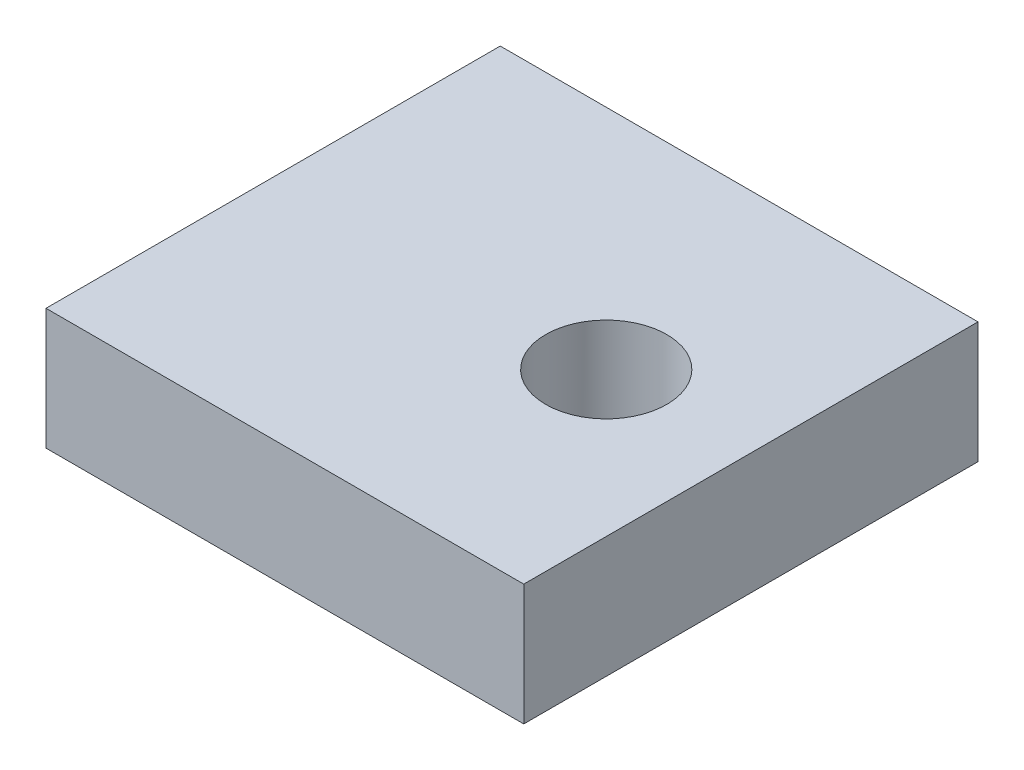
ISO-10303-21;
HEADER;
FILE_DESCRIPTION(('STEP AP214'),'2;1');
FILE_NAME('part.step','',(''),(''),'','','');
FILE_SCHEMA(('AUTOMOTIVE_DESIGN { 1 0 10303 214 1 1 1 1 }'));
ENDSEC;
DATA;
#1=APPLICATION_CONTEXT('core data for automotive mechanical design processes');
#2=APPLICATION_PROTOCOL_DEFINITION('international standard','automotive_design',2000,#1);
#3=PRODUCT_CONTEXT('',#1,'mechanical');
#4=PRODUCT('Part','Part','',(#3));
#5=PRODUCT_RELATED_PRODUCT_CATEGORY('part','',(#4));
#6=PRODUCT_DEFINITION_FORMATION('','',#4);
#7=PRODUCT_DEFINITION_CONTEXT('part definition',#1,'design');
#8=PRODUCT_DEFINITION('design','',#6,#7);
#9=PRODUCT_DEFINITION_SHAPE('','',#8);
#10=(LENGTH_UNIT() NAMED_UNIT(*) SI_UNIT(.MILLI.,.METRE.));
#11=(NAMED_UNIT(*) PLANE_ANGLE_UNIT() SI_UNIT($,.RADIAN.));
#12=(NAMED_UNIT(*) SI_UNIT($,.STERADIAN.) SOLID_ANGLE_UNIT());
#13=UNCERTAINTY_MEASURE_WITH_UNIT(LENGTH_MEASURE(1.E-05),#10,'distance_accuracy_value','');
#14=(GEOMETRIC_REPRESENTATION_CONTEXT(3) GLOBAL_UNCERTAINTY_ASSIGNED_CONTEXT((#13)) GLOBAL_UNIT_ASSIGNED_CONTEXT((#10,
#11,#12)) REPRESENTATION_CONTEXT('',''));
#15=CARTESIAN_POINT('',(0.,0.,0.));
#16=DIRECTION('',(0.,0.,1.));
#17=DIRECTION('',(1.,0.,0.));
#18=AXIS2_PLACEMENT_3D('',#15,#16,#17);
#19=CARTESIAN_POINT('',(42.9208778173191,81.646975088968,37.5));
#20=DIRECTION('',(-1.,0.,0.));
#21=DIRECTION('',(0.,0.,1.));
#22=AXIS2_PLACEMENT_3D('',#19,#20,#21);
#23=PLANE('',#22);
#24=DIRECTION('',(0.,1.,0.));
#25=VECTOR('',#24,1.);
#26=CARTESIAN_POINT('',(42.9208778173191,81.646975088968,-37.5));
#27=LINE('',#26,#25);
#28=CARTESIAN_POINT('',(42.9208778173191,61.646975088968,-37.5));
#29=VERTEX_POINT('',#28);
#30=CARTESIAN_POINT('',(42.9208778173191,81.646975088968,-37.5));
#31=VERTEX_POINT('',#30);
#32=EDGE_CURVE('E76',#29,#31,#27,.T.);
#33=ORIENTED_EDGE('',*,*,#32,.T.);
#34=DIRECTION('',(0.,0.,-1.));
#35=VECTOR('',#34,1.);
#36=CARTESIAN_POINT('',(42.9208778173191,81.646975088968,37.5));
#37=LINE('',#36,#35);
#38=CARTESIAN_POINT('',(42.9208778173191,81.646975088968,37.5));
#39=VERTEX_POINT('',#38);
#40=EDGE_CURVE('E11',#39,#31,#37,.T.);
#41=ORIENTED_EDGE('',*,*,#40,.F.);
#42=DIRECTION('',(0.,1.,0.));
#43=VECTOR('',#42,1.);
#44=CARTESIAN_POINT('',(42.9208778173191,81.646975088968,37.5));
#45=LINE('',#44,#43);
#46=CARTESIAN_POINT('',(42.9208778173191,61.646975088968,37.5));
#47=VERTEX_POINT('',#46);
#48=EDGE_CURVE('E97',#47,#39,#45,.T.);
#49=ORIENTED_EDGE('',*,*,#48,.F.);
#50=DIRECTION('',(0.,0.,-1.));
#51=VECTOR('',#50,1.);
#52=CARTESIAN_POINT('',(42.9208778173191,61.646975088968,37.5));
#53=LINE('',#52,#51);
#54=EDGE_CURVE('E88',#47,#29,#53,.T.);
#55=ORIENTED_EDGE('',*,*,#54,.T.);
#56=EDGE_LOOP('',(#33,#41,#49,#55));
#57=FACE_BOUND('',#56,.T.);
#58=ADVANCED_FACE('F31',(#57),#23,.F.);
#59=CARTESIAN_POINT('',(42.9208778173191,81.646975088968,37.5));
#60=DIRECTION('',(0.,-1.,0.));
#61=DIRECTION('',(1.,0.,0.));
#62=AXIS2_PLACEMENT_3D('',#59,#60,#61);
#63=PLANE('',#62);
#64=CARTESIAN_POINT('',(19.0392645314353,81.646975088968,0.));
#65=DIRECTION('',(0.,1.,0.));
#66=DIRECTION('',(0.,0.,1.));
#67=AXIS2_PLACEMENT_3D('',#64,#65,#66);
#68=CIRCLE('',#67,10.);
#69=CARTESIAN_POINT('',(19.0392645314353,81.646975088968,10.));
#70=VERTEX_POINT('',#69);
#71=EDGE_CURVE('E91',#70,#70,#68,.T.);
#72=ORIENTED_EDGE('',*,*,#71,.F.);
#73=EDGE_LOOP('',(#72));
#74=FACE_BOUND('',#73,.T.);
#75=DIRECTION('',(-1.,0.,0.));
#76=VECTOR('',#75,1.);
#77=CARTESIAN_POINT('',(42.9208778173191,81.646975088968,-37.5));
#78=LINE('',#77,#76);
#79=CARTESIAN_POINT('',(-35.9607354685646,81.646975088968,-37.5));
#80=VERTEX_POINT('',#79);
#81=EDGE_CURVE('E72',#31,#80,#78,.T.);
#82=ORIENTED_EDGE('',*,*,#81,.T.);
#83=DIRECTION('',(0.,0.,-1.));
#84=VECTOR('',#83,1.);
#85=CARTESIAN_POINT('',(-35.9607354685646,81.646975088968,37.5));
#86=LINE('',#85,#84);
#87=CARTESIAN_POINT('',(-35.9607354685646,81.646975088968,37.5));
#88=VERTEX_POINT('',#87);
#89=EDGE_CURVE('E39',#88,#80,#86,.T.);
#90=ORIENTED_EDGE('',*,*,#89,.F.);
#91=DIRECTION('',(-1.,0.,0.));
#92=VECTOR('',#91,1.);
#93=CARTESIAN_POINT('',(42.9208778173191,81.646975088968,37.5));
#94=LINE('',#93,#92);
#95=EDGE_CURVE('E84',#39,#88,#94,.T.);
#96=ORIENTED_EDGE('',*,*,#95,.F.);
#97=ORIENTED_EDGE('',*,*,#40,.T.);
#98=EDGE_LOOP('',(#82,#90,#96,#97));
#99=FACE_BOUND('',#98,.T.);
#100=ADVANCED_FACE('F83',(#74,#99),#63,.F.);
#101=CARTESIAN_POINT('',(-35.9607354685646,81.646975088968,37.5));
#102=DIRECTION('',(1.,0.,0.));
#103=DIRECTION('',(0.,0.,-1.));
#104=AXIS2_PLACEMENT_3D('',#101,#102,#103);
#105=PLANE('',#104);
#106=DIRECTION('',(0.,-1.,0.));
#107=VECTOR('',#106,1.);
#108=CARTESIAN_POINT('',(-35.9607354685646,81.646975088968,-37.5));
#109=LINE('',#108,#107);
#110=CARTESIAN_POINT('',(-35.9607354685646,61.646975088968,-37.5));
#111=VERTEX_POINT('',#110);
#112=EDGE_CURVE('E77',#80,#111,#109,.T.);
#113=ORIENTED_EDGE('',*,*,#112,.T.);
#114=DIRECTION('',(0.,0.,-1.));
#115=VECTOR('',#114,1.);
#116=CARTESIAN_POINT('',(-35.9607354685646,61.646975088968,37.5));
#117=LINE('',#116,#115);
#118=CARTESIAN_POINT('',(-35.9607354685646,61.646975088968,37.5));
#119=VERTEX_POINT('',#118);
#120=EDGE_CURVE('E103',#119,#111,#117,.T.);
#121=ORIENTED_EDGE('',*,*,#120,.F.);
#122=DIRECTION('',(0.,-1.,0.));
#123=VECTOR('',#122,1.);
#124=CARTESIAN_POINT('',(-35.9607354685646,81.646975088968,37.5));
#125=LINE('',#124,#123);
#126=EDGE_CURVE('E51',#88,#119,#125,.T.);
#127=ORIENTED_EDGE('',*,*,#126,.F.);
#128=ORIENTED_EDGE('',*,*,#89,.T.);
#129=EDGE_LOOP('',(#113,#121,#127,#128));
#130=FACE_BOUND('',#129,.T.);
#131=ADVANCED_FACE('F107',(#130),#105,.F.);
#132=CARTESIAN_POINT('',(42.9208778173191,61.646975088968,37.5));
#133=DIRECTION('',(0.,1.,0.));
#134=DIRECTION('',(-1.,0.,0.));
#135=AXIS2_PLACEMENT_3D('',#132,#133,#134);
#136=PLANE('',#135);
#137=CARTESIAN_POINT('',(19.0392645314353,61.646975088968,0.));
#138=DIRECTION('',(0.,1.,0.));
#139=DIRECTION('',(-1.,0.,0.));
#140=AXIS2_PLACEMENT_3D('',#137,#138,#139);
#141=CIRCLE('',#140,10.);
#142=CARTESIAN_POINT('',(9.03926453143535,61.646975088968,0.));
#143=VERTEX_POINT('',#142);
#144=EDGE_CURVE('E34',#143,#143,#141,.T.);
#145=ORIENTED_EDGE('',*,*,#144,.T.);
#146=EDGE_LOOP('',(#145));
#147=FACE_BOUND('',#146,.T.);
#148=DIRECTION('',(1.,0.,0.));
#149=VECTOR('',#148,1.);
#150=CARTESIAN_POINT('',(42.9208778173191,61.646975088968,-37.5));
#151=LINE('',#150,#149);
#152=EDGE_CURVE('E95',#111,#29,#151,.T.);
#153=ORIENTED_EDGE('',*,*,#152,.T.);
#154=ORIENTED_EDGE('',*,*,#54,.F.);
#155=DIRECTION('',(1.,0.,0.));
#156=VECTOR('',#155,1.);
#157=CARTESIAN_POINT('',(42.9208778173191,61.646975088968,37.5));
#158=LINE('',#157,#156);
#159=EDGE_CURVE('E46',#119,#47,#158,.T.);
#160=ORIENTED_EDGE('',*,*,#159,.F.);
#161=ORIENTED_EDGE('',*,*,#120,.T.);
#162=EDGE_LOOP('',(#153,#154,#160,#161));
#163=FACE_BOUND('',#162,.T.);
#164=ADVANCED_FACE('F109',(#147,#163),#136,.F.);
#165=CARTESIAN_POINT('',(42.9208778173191,61.646975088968,37.5));
#166=DIRECTION('',(0.,0.,-1.));
#167=DIRECTION('',(-1.,0.,0.));
#168=AXIS2_PLACEMENT_3D('',#165,#166,#167);
#169=PLANE('',#168);
#170=ORIENTED_EDGE('',*,*,#48,.T.);
#171=ORIENTED_EDGE('',*,*,#95,.T.);
#172=ORIENTED_EDGE('',*,*,#126,.T.);
#173=ORIENTED_EDGE('',*,*,#159,.T.);
#174=EDGE_LOOP('',(#170,#171,#172,#173));
#175=FACE_BOUND('',#174,.T.);
#176=ADVANCED_FACE('F110',(#175),#169,.F.);
#177=CARTESIAN_POINT('',(42.9208778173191,61.646975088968,-37.5));
#178=DIRECTION('',(0.,0.,-1.));
#179=DIRECTION('',(-1.,0.,0.));
#180=AXIS2_PLACEMENT_3D('',#177,#178,#179);
#181=PLANE('',#180);
#182=ORIENTED_EDGE('',*,*,#32,.F.);
#183=ORIENTED_EDGE('',*,*,#152,.F.);
#184=ORIENTED_EDGE('',*,*,#112,.F.);
#185=ORIENTED_EDGE('',*,*,#81,.F.);
#186=EDGE_LOOP('',(#182,#183,#184,#185));
#187=FACE_BOUND('',#186,.T.);
#188=ADVANCED_FACE('F73',(#187),#181,.T.);
#189=CARTESIAN_POINT('',(19.0392645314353,6.64697508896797,0.));
#190=DIRECTION('',(0.,1.,0.));
#191=DIRECTION('',(0.,0.,1.));
#192=AXIS2_PLACEMENT_3D('',#189,#190,#191);
#193=CYLINDRICAL_SURFACE('',#192,10.);
#194=ORIENTED_EDGE('',*,*,#71,.T.);
#195=EDGE_LOOP('',(#194));
#196=FACE_BOUND('',#195,.T.);
#197=ORIENTED_EDGE('',*,*,#144,.F.);
#198=EDGE_LOOP('',(#197));
#199=FACE_BOUND('',#198,.T.);
#200=ADVANCED_FACE('F117',(#196,#199),#193,.F.);
#201=CLOSED_SHELL('',(#58,#100,#131,#164,#176,#188,#200));
#202=MANIFOLD_SOLID_BREP('B2',#201);
#203=ADVANCED_BREP_SHAPE_REPRESENTATION('',(#18,#202),#14);
#204=SHAPE_DEFINITION_REPRESENTATION(#9,#203);
ENDSEC;
END-ISO-10303-21;
